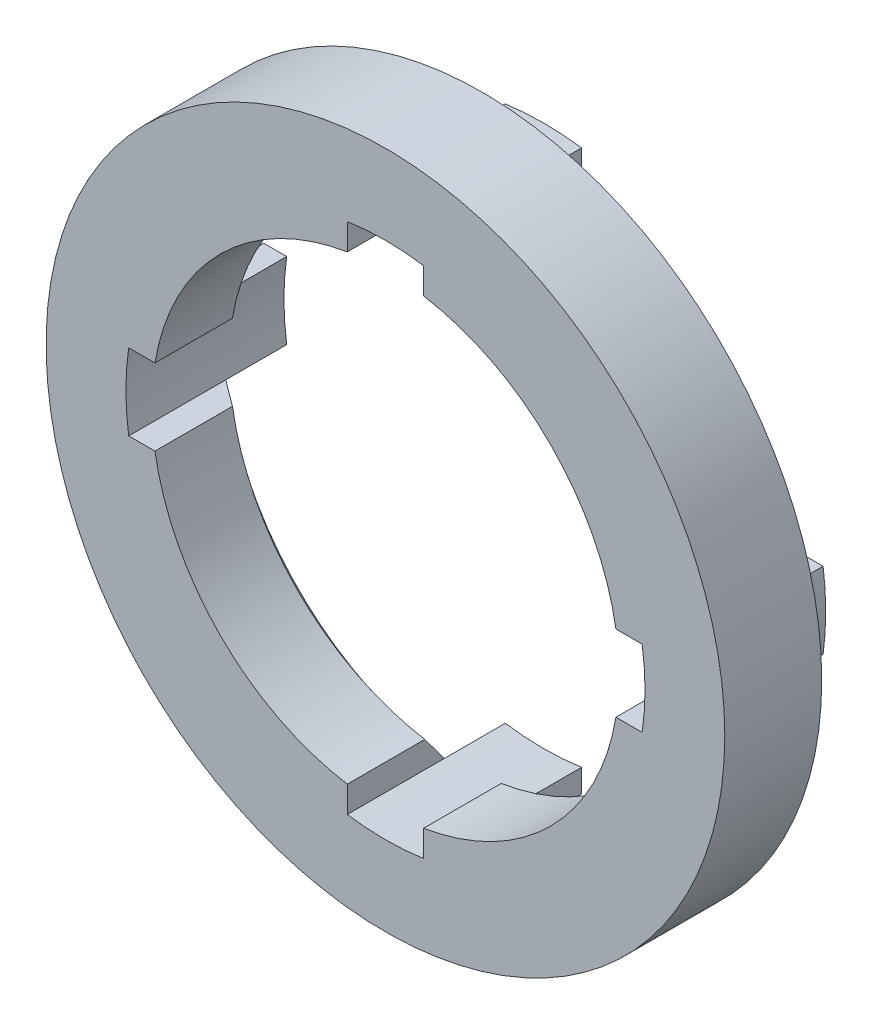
from build123d import *

# Parameters (mm, degrees)
SKETCH1_R           = 22.225
BOSS_EXTRUDE1_DEPTH = 6.35
CUT_EXTRUDE1_REACH  = 34.066
SKETCH2_R           = 15.3
CUT_EXTRUDE2_REACH  = 34.066
BOSS_EXTRUDE2_DEPTH = 4
CIRPATTERN1_COUNT   = 4


with BuildPart() as part:
    # Sketch1 → Boss-Extrude1 (new body)
    with BuildSketch(Plane.XY):
        Circle(SKETCH1_R)
    extrude(amount=BOSS_EXTRUDE1_DEPTH)

    # Sketch2 → Cut-Extrude1 (cut, up to next)
    with BuildSketch(Plane.XY.offset(6.35), mode=Mode.PRIVATE) as cut_extrude1_sk1:
        Circle(SKETCH2_R)
    cut_extrude1_tool1 = extrude(cut_extrude1_sk1.sketch, amount=-CUT_EXTRUDE1_REACH, mode=Mode.PRIVATE) & part.part
    add(cut_extrude1_tool1.solids().sort_by_distance((0, 0, 6.35))[0], mode=Mode.SUBTRACT)

    # Sketch3 → Cut-Revolve1 (revolve, cut)
    with BuildSketch(Plane(origin=(0, 0, 0), x_dir=(1, 0, 0), z_dir=(0, 1, 0)), mode=Mode.PRIVATE) as cut_revolve1_sk:
        Polygon((-15, -1.498915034), (-17, 0), (-15, 0), align=None)
    revolve(cut_revolve1_sk.sketch.rotate(Axis((0, 0, 0), (0, 0, 1)), 180), axis=Axis((0, 0, 0), (0, 0, 1)), mode=Mode.SUBTRACT)

    # Sketch4 → Cut-Extrude2 (cut, up to next)
    with BuildSketch(Plane.XY.offset(6.35), mode=Mode.PRIVATE) as cut_extrude2_sk1:
        with BuildLine():
            Line((-16.815171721, 2.5), (-15.094369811, 2.5))
            Line((-15.094369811, 2.5), (-15.094369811, -2.5))
            Line((-15.094369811, -2.5), (-16.815171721, -2.5))
            ThreePointArc((-16.815171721, -2.5), (-17, 0), (-16.815171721, 2.5))
        make_face()
    cut_extrude2_tool1 = extrude(cut_extrude2_sk1.sketch, amount=-CUT_EXTRUDE2_REACH, mode=Mode.PRIVATE) & part.part
    cut_extrude2 = cut_extrude2_tool1.solids().sort_by_distance((-16.017269, 0, 6.35))[0]
    add(cut_extrude2, mode=Mode.SUBTRACT)

    # Sketch5 → Boss-Extrude2 (add)
    with BuildSketch(Plane(origin=(0, 0, 0), x_dir=(-1, 0, 0), z_dir=(0, 0, -1))):
        with BuildLine():
            Line((-16.815171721, 2.5), (-18.315171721, 2.5))
            ThreePointArc((-18.315171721, 2.5), (-18.485007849, 0), (-18.315171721, -2.5))
            Line((-18.315171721, -2.5), (-16.815171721, -2.5))
            ThreePointArc((-16.815171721, -2.5), (-17, 0), (-16.815171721, 2.5))
        make_face()
    boss_extrude2 = extrude(amount=BOSS_EXTRUDE2_DEPTH)

    # CirPattern1: Cut-Extrude2, Boss-Extrude2 ×4 about axis
    cirpattern1_axis = Axis((0, 0, 0), (0, 0, 1))
    add([cut_extrude2.rotate(cirpattern1_axis, i * 360 / CIRPATTERN1_COUNT) for i in range(1, CIRPATTERN1_COUNT)], mode=Mode.SUBTRACT)
    add([boss_extrude2.rotate(cirpattern1_axis, i * 360 / CIRPATTERN1_COUNT) for i in range(1, CIRPATTERN1_COUNT)])


solid = part.part
